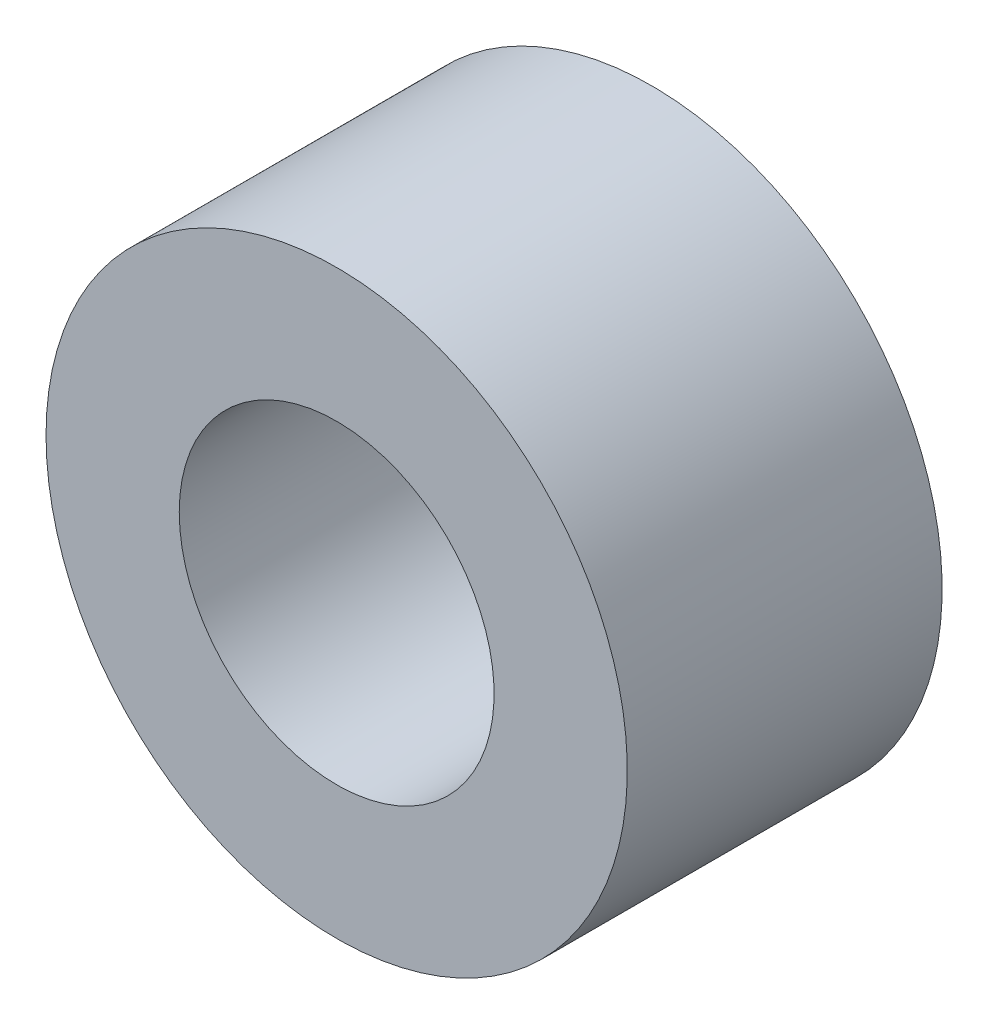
ISO-10303-21;
HEADER;
FILE_DESCRIPTION(('STEP AP214'),'2;1');
FILE_NAME('part.step','',(''),(''),'','','');
FILE_SCHEMA(('AUTOMOTIVE_DESIGN { 1 0 10303 214 1 1 1 1 }'));
ENDSEC;
DATA;
#1=APPLICATION_CONTEXT('core data for automotive mechanical design processes');
#2=APPLICATION_PROTOCOL_DEFINITION('international standard','automotive_design',2000,#1);
#3=PRODUCT_CONTEXT('',#1,'mechanical');
#4=PRODUCT('Part','Part','',(#3));
#5=PRODUCT_RELATED_PRODUCT_CATEGORY('part','',(#4));
#6=PRODUCT_DEFINITION_FORMATION('','',#4);
#7=PRODUCT_DEFINITION_CONTEXT('part definition',#1,'design');
#8=PRODUCT_DEFINITION('design','',#6,#7);
#9=PRODUCT_DEFINITION_SHAPE('','',#8);
#10=(LENGTH_UNIT() NAMED_UNIT(*) SI_UNIT(.MILLI.,.METRE.));
#11=(NAMED_UNIT(*) PLANE_ANGLE_UNIT() SI_UNIT($,.RADIAN.));
#12=(NAMED_UNIT(*) SI_UNIT($,.STERADIAN.) SOLID_ANGLE_UNIT());
#13=UNCERTAINTY_MEASURE_WITH_UNIT(LENGTH_MEASURE(1.E-05),#10,'distance_accuracy_value','');
#14=(GEOMETRIC_REPRESENTATION_CONTEXT(3) GLOBAL_UNCERTAINTY_ASSIGNED_CONTEXT((#13)) GLOBAL_UNIT_ASSIGNED_CONTEXT((#10,
#11,#12)) REPRESENTATION_CONTEXT('',''));
#15=CARTESIAN_POINT('',(0.,0.,0.));
#16=DIRECTION('',(0.,0.,1.));
#17=DIRECTION('',(1.,0.,0.));
#18=AXIS2_PLACEMENT_3D('',#15,#16,#17);
#19=CARTESIAN_POINT('',(0.,0.,6.5));
#20=DIRECTION('',(0.,0.,1.));
#21=DIRECTION('',(1.,0.,0.));
#22=AXIS2_PLACEMENT_3D('',#19,#20,#21);
#23=PLANE('',#22);
#24=CARTESIAN_POINT('',(0.,0.,6.5));
#25=DIRECTION('',(0.,0.,1.));
#26=DIRECTION('',(1.,0.,0.));
#27=AXIS2_PLACEMENT_3D('',#24,#25,#26);
#28=CIRCLE('',#27,6.);
#29=CARTESIAN_POINT('',(-6.,0.,6.5));
#30=VERTEX_POINT('',#29);
#31=EDGE_CURVE('E12',#30,#30,#28,.T.);
#32=ORIENTED_EDGE('',*,*,#31,.T.);
#33=EDGE_LOOP('',(#32));
#34=FACE_BOUND('',#33,.T.);
#35=CARTESIAN_POINT('',(0.,0.,6.5));
#36=DIRECTION('',(0.,0.,1.));
#37=DIRECTION('',(1.,0.,0.));
#38=AXIS2_PLACEMENT_3D('',#35,#36,#37);
#39=CIRCLE('',#38,3.25);
#40=CARTESIAN_POINT('',(-3.25,0.,6.5));
#41=VERTEX_POINT('',#40);
#42=EDGE_CURVE('E53',#41,#41,#39,.T.);
#43=ORIENTED_EDGE('',*,*,#42,.F.);
#44=EDGE_LOOP('',(#43));
#45=FACE_BOUND('',#44,.T.);
#46=ADVANCED_FACE('F42',(#34,#45),#23,.T.);
#47=CARTESIAN_POINT('',(0.,0.,0.));
#48=DIRECTION('',(0.,0.,1.));
#49=DIRECTION('',(1.,0.,0.));
#50=AXIS2_PLACEMENT_3D('',#47,#48,#49);
#51=PLANE('',#50);
#52=CARTESIAN_POINT('',(0.,0.,0.));
#53=DIRECTION('',(0.,0.,1.));
#54=DIRECTION('',(1.,0.,0.));
#55=AXIS2_PLACEMENT_3D('',#52,#53,#54);
#56=CIRCLE('',#55,6.);
#57=CARTESIAN_POINT('',(-6.,0.,0.));
#58=VERTEX_POINT('',#57);
#59=EDGE_CURVE('E46',#58,#58,#56,.T.);
#60=ORIENTED_EDGE('',*,*,#59,.F.);
#61=EDGE_LOOP('',(#60));
#62=FACE_BOUND('',#61,.T.);
#63=CARTESIAN_POINT('',(0.,0.,0.));
#64=DIRECTION('',(0.,0.,1.));
#65=DIRECTION('',(1.,0.,0.));
#66=AXIS2_PLACEMENT_3D('',#63,#64,#65);
#67=CIRCLE('',#66,3.25);
#68=CARTESIAN_POINT('',(-3.25,0.,0.));
#69=VERTEX_POINT('',#68);
#70=EDGE_CURVE('E55',#69,#69,#67,.T.);
#71=ORIENTED_EDGE('',*,*,#70,.T.);
#72=EDGE_LOOP('',(#71));
#73=FACE_BOUND('',#72,.T.);
#74=ADVANCED_FACE('F65',(#62,#73),#51,.F.);
#75=CARTESIAN_POINT('',(0.,0.,6.5));
#76=DIRECTION('',(0.,0.,-1.));
#77=DIRECTION('',(-1.,0.,0.));
#78=AXIS2_PLACEMENT_3D('',#75,#76,#77);
#79=CYLINDRICAL_SURFACE('',#78,6.);
#80=CARTESIAN_POINT('',(-6.,0.,6.5));
#81=CARTESIAN_POINT('',(-6.,0.,6.43229166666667));
#82=CARTESIAN_POINT('',(-6.,0.,6.36458333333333));
#83=CARTESIAN_POINT('',(-6.,0.,6.22916666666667));
#84=CARTESIAN_POINT('',(-6.,0.,6.16145833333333));
#85=CARTESIAN_POINT('',(-6.,0.,6.02604166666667));
#86=CARTESIAN_POINT('',(-6.,0.,5.95833333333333));
#87=CARTESIAN_POINT('',(-6.,0.,5.82291666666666));
#88=CARTESIAN_POINT('',(-6.,0.,5.75520833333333));
#89=CARTESIAN_POINT('',(-6.,0.,5.61979166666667));
#90=CARTESIAN_POINT('',(-6.,0.,5.55208333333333));
#91=CARTESIAN_POINT('',(-6.,0.,5.41666666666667));
#92=CARTESIAN_POINT('',(-6.,0.,5.34895833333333));
#93=CARTESIAN_POINT('',(-6.,0.,5.21354166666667));
#94=CARTESIAN_POINT('',(-6.,0.,5.14583333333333));
#95=CARTESIAN_POINT('',(-6.,0.,5.01041666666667));
#96=CARTESIAN_POINT('',(-6.,0.,4.94270833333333));
#97=CARTESIAN_POINT('',(-6.,0.,4.80729166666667));
#98=CARTESIAN_POINT('',(-6.,0.,4.73958333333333));
#99=CARTESIAN_POINT('',(-6.,0.,4.60416666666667));
#100=CARTESIAN_POINT('',(-6.,0.,4.53645833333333));
#101=CARTESIAN_POINT('',(-6.,0.,4.40104166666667));
#102=CARTESIAN_POINT('',(-6.,0.,4.33333333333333));
#103=CARTESIAN_POINT('',(-6.,0.,4.19791666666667));
#104=CARTESIAN_POINT('',(-6.,0.,4.13020833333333));
#105=CARTESIAN_POINT('',(-6.,0.,3.99479166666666));
#106=CARTESIAN_POINT('',(-6.,0.,3.92708333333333));
#107=CARTESIAN_POINT('',(-6.,0.,3.79166666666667));
#108=CARTESIAN_POINT('',(-6.,0.,3.72395833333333));
#109=CARTESIAN_POINT('',(-6.,0.,3.58854166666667));
#110=CARTESIAN_POINT('',(-6.,0.,3.52083333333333));
#111=CARTESIAN_POINT('',(-6.,0.,3.38541666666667));
#112=CARTESIAN_POINT('',(-6.,0.,3.31770833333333));
#113=CARTESIAN_POINT('',(-6.,0.,3.18229166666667));
#114=CARTESIAN_POINT('',(-6.,0.,3.11458333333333));
#115=CARTESIAN_POINT('',(-6.,0.,2.97916666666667));
#116=CARTESIAN_POINT('',(-6.,0.,2.91145833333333));
#117=CARTESIAN_POINT('',(-6.,0.,2.77604166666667));
#118=CARTESIAN_POINT('',(-6.,0.,2.70833333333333));
#119=CARTESIAN_POINT('',(-6.,0.,2.57291666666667));
#120=CARTESIAN_POINT('',(-6.,0.,2.50520833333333));
#121=CARTESIAN_POINT('',(-6.,0.,2.36979166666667));
#122=CARTESIAN_POINT('',(-6.,0.,2.30208333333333));
#123=CARTESIAN_POINT('',(-6.,0.,2.16666666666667));
#124=CARTESIAN_POINT('',(-6.,0.,2.09895833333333));
#125=CARTESIAN_POINT('',(-6.,0.,1.96354166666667));
#126=CARTESIAN_POINT('',(-6.,0.,1.89583333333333));
#127=CARTESIAN_POINT('',(-6.,0.,1.76041666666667));
#128=CARTESIAN_POINT('',(-6.,0.,1.69270833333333));
#129=CARTESIAN_POINT('',(-6.,0.,1.55729166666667));
#130=CARTESIAN_POINT('',(-6.,0.,1.48958333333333));
#131=CARTESIAN_POINT('',(-6.,0.,1.35416666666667));
#132=CARTESIAN_POINT('',(-6.,0.,1.28645833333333));
#133=CARTESIAN_POINT('',(-6.,0.,1.15104166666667));
#134=CARTESIAN_POINT('',(-6.,0.,1.08333333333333));
#135=CARTESIAN_POINT('',(-6.,0.,0.947916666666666));
#136=CARTESIAN_POINT('',(-6.,0.,0.880208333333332));
#137=CARTESIAN_POINT('',(-6.,0.,0.744791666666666));
#138=CARTESIAN_POINT('',(-6.,0.,0.677083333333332));
#139=CARTESIAN_POINT('',(-6.,0.,0.541666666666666));
#140=CARTESIAN_POINT('',(-6.,0.,0.473958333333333));
#141=CARTESIAN_POINT('',(-6.,0.,0.338541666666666));
#142=CARTESIAN_POINT('',(-6.,0.,0.270833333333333));
#143=CARTESIAN_POINT('',(-6.,0.,0.135416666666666));
#144=CARTESIAN_POINT('',(-6.,0.,0.0677083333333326));
#145=CARTESIAN_POINT('',(-6.,0.,0.));
#146=B_SPLINE_CURVE_WITH_KNOTS('',3,(#80,#81,#82,#83,#84,#85,#86,#87,#88,#89,#90,#91,#92,#93,
#94,#95,#96,#97,#98,#99,#100,#101,#102,#103,#104,#105,#106,#107,#108,#109,#110,#111,#112,#113,
#114,#115,#116,#117,#118,#119,#120,#121,#122,#123,#124,#125,#126,#127,#128,#129,#130,#131,#132,
#133,#134,#135,#136,#137,#138,#139,#140,#141,#142,#143,#144,#145),.UNSPECIFIED.,.F.,.F.,(4,2,2,
2,2,2,2,2,2,2,2,2,2,2,2,2,2,2,2,2,2,2,2,2,2,2,2,2,2,2,2,2,4),(0.,0.203125,0.40625,
0.609375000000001,0.812500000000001,1.015625,1.21875,1.421875,1.625,1.828125,2.03125,2.234375,
2.4375,2.640625,2.84375,3.046875,3.25,3.453125,3.65625,3.859375,4.0625,4.265625,4.46875,
4.671875,4.875,5.078125,5.28125,5.484375,5.6875,5.890625,6.09375,6.296875,6.5),.UNSPECIFIED.);
#147=EDGE_CURVE('BSEAM44',#30,#58,#146,.T.);
#148=ORIENTED_EDGE('',*,*,#31,.F.);
#149=ORIENTED_EDGE('',*,*,#59,.T.);
#150=ORIENTED_EDGE('',*,*,#147,.T.);
#151=ORIENTED_EDGE('',*,*,#147,.F.);
#152=EDGE_LOOP('',(#148,#150,#149,#151));
#153=FACE_BOUND('',#152,.T.);
#154=ADVANCED_FACE('F44',(#153),#79,.T.);
#155=CARTESIAN_POINT('',(0.,0.,6.5));
#156=DIRECTION('',(0.,0.,-1.));
#157=DIRECTION('',(-1.,0.,0.));
#158=AXIS2_PLACEMENT_3D('',#155,#156,#157);
#159=CYLINDRICAL_SURFACE('',#158,3.25);
#160=CARTESIAN_POINT('',(-3.25,0.,6.5));
#161=CARTESIAN_POINT('',(-3.25,0.,6.43229166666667));
#162=CARTESIAN_POINT('',(-3.25,0.,6.36458333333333));
#163=CARTESIAN_POINT('',(-3.25,0.,6.22916666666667));
#164=CARTESIAN_POINT('',(-3.25,0.,6.16145833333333));
#165=CARTESIAN_POINT('',(-3.25,0.,6.02604166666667));
#166=CARTESIAN_POINT('',(-3.25,0.,5.95833333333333));
#167=CARTESIAN_POINT('',(-3.25,0.,5.82291666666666));
#168=CARTESIAN_POINT('',(-3.25,0.,5.75520833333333));
#169=CARTESIAN_POINT('',(-3.25,0.,5.61979166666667));
#170=CARTESIAN_POINT('',(-3.25,0.,5.55208333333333));
#171=CARTESIAN_POINT('',(-3.25,0.,5.41666666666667));
#172=CARTESIAN_POINT('',(-3.25,0.,5.34895833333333));
#173=CARTESIAN_POINT('',(-3.25,0.,5.21354166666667));
#174=CARTESIAN_POINT('',(-3.25,0.,5.14583333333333));
#175=CARTESIAN_POINT('',(-3.25,0.,5.01041666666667));
#176=CARTESIAN_POINT('',(-3.25,0.,4.94270833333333));
#177=CARTESIAN_POINT('',(-3.25,0.,4.80729166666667));
#178=CARTESIAN_POINT('',(-3.25,0.,4.73958333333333));
#179=CARTESIAN_POINT('',(-3.25,0.,4.60416666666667));
#180=CARTESIAN_POINT('',(-3.25,0.,4.53645833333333));
#181=CARTESIAN_POINT('',(-3.25,0.,4.40104166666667));
#182=CARTESIAN_POINT('',(-3.25,0.,4.33333333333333));
#183=CARTESIAN_POINT('',(-3.25,0.,4.19791666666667));
#184=CARTESIAN_POINT('',(-3.25,0.,4.13020833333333));
#185=CARTESIAN_POINT('',(-3.25,0.,3.99479166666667));
#186=CARTESIAN_POINT('',(-3.25,0.,3.92708333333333));
#187=CARTESIAN_POINT('',(-3.25,0.,3.79166666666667));
#188=CARTESIAN_POINT('',(-3.25,0.,3.72395833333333));
#189=CARTESIAN_POINT('',(-3.25,0.,3.58854166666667));
#190=CARTESIAN_POINT('',(-3.25,0.,3.52083333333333));
#191=CARTESIAN_POINT('',(-3.25,0.,3.38541666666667));
#192=CARTESIAN_POINT('',(-3.25,0.,3.31770833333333));
#193=CARTESIAN_POINT('',(-3.25,0.,3.18229166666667));
#194=CARTESIAN_POINT('',(-3.25,0.,3.11458333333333));
#195=CARTESIAN_POINT('',(-3.25,0.,2.97916666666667));
#196=CARTESIAN_POINT('',(-3.25,0.,2.91145833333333));
#197=CARTESIAN_POINT('',(-3.25,0.,2.77604166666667));
#198=CARTESIAN_POINT('',(-3.25,0.,2.70833333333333));
#199=CARTESIAN_POINT('',(-3.25,0.,2.57291666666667));
#200=CARTESIAN_POINT('',(-3.25,0.,2.50520833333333));
#201=CARTESIAN_POINT('',(-3.25,0.,2.36979166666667));
#202=CARTESIAN_POINT('',(-3.25,0.,2.30208333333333));
#203=CARTESIAN_POINT('',(-3.25,0.,2.16666666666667));
#204=CARTESIAN_POINT('',(-3.25,0.,2.09895833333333));
#205=CARTESIAN_POINT('',(-3.25,0.,1.96354166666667));
#206=CARTESIAN_POINT('',(-3.25,0.,1.89583333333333));
#207=CARTESIAN_POINT('',(-3.25,0.,1.76041666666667));
#208=CARTESIAN_POINT('',(-3.25,0.,1.69270833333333));
#209=CARTESIAN_POINT('',(-3.25,0.,1.55729166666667));
#210=CARTESIAN_POINT('',(-3.25,0.,1.48958333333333));
#211=CARTESIAN_POINT('',(-3.25,0.,1.35416666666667));
#212=CARTESIAN_POINT('',(-3.25,0.,1.28645833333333));
#213=CARTESIAN_POINT('',(-3.25,0.,1.15104166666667));
#214=CARTESIAN_POINT('',(-3.25,0.,1.08333333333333));
#215=CARTESIAN_POINT('',(-3.25,0.,0.947916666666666));
#216=CARTESIAN_POINT('',(-3.25,0.,0.880208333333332));
#217=CARTESIAN_POINT('',(-3.25,0.,0.744791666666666));
#218=CARTESIAN_POINT('',(-3.25,0.,0.677083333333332));
#219=CARTESIAN_POINT('',(-3.25,0.,0.541666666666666));
#220=CARTESIAN_POINT('',(-3.25,0.,0.473958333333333));
#221=CARTESIAN_POINT('',(-3.25,0.,0.338541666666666));
#222=CARTESIAN_POINT('',(-3.25,0.,0.270833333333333));
#223=CARTESIAN_POINT('',(-3.25,0.,0.135416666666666));
#224=CARTESIAN_POINT('',(-3.25,0.,0.0677083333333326));
#225=CARTESIAN_POINT('',(-3.25,0.,0.));
#226=B_SPLINE_CURVE_WITH_KNOTS('',3,(#160,#161,#162,#163,#164,#165,#166,#167,#168,#169,#170,
#171,#172,#173,#174,#175,#176,#177,#178,#179,#180,#181,#182,#183,#184,#185,#186,#187,#188,#189,
#190,#191,#192,#193,#194,#195,#196,#197,#198,#199,#200,#201,#202,#203,#204,#205,#206,#207,#208,
#209,#210,#211,#212,#213,#214,#215,#216,#217,#218,#219,#220,#221,#222,#223,#224,#225),
.UNSPECIFIED.,.F.,.F.,(4,2,2,2,2,2,2,2,2,2,2,2,2,2,2,2,2,2,2,2,2,2,2,2,2,2,2,2,2,2,2,2,4),(0.,
0.203124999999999,0.40625,0.609375,0.8125,1.015625,1.21875,1.421875,1.625,1.828125,2.03125,
2.234375,2.4375,2.640625,2.84375,3.046875,3.25,3.453125,3.65625,3.859375,4.0625,4.265625,
4.46875,4.671875,4.875,5.078125,5.28125,5.484375,5.6875,5.890625,6.09375,6.296875,6.5),.UNSPECIFIED.);
#227=EDGE_CURVE('BSEAM61',#41,#69,#226,.T.);
#228=ORIENTED_EDGE('',*,*,#42,.T.);
#229=ORIENTED_EDGE('',*,*,#70,.F.);
#230=ORIENTED_EDGE('',*,*,#227,.T.);
#231=ORIENTED_EDGE('',*,*,#227,.F.);
#232=EDGE_LOOP('',(#228,#230,#229,#231));
#233=FACE_BOUND('',#232,.T.);
#234=ADVANCED_FACE('F61',(#233),#159,.F.);
#235=CLOSED_SHELL('',(#46,#74,#154,#234));
#236=MANIFOLD_SOLID_BREP('B2',#235);
#237=ADVANCED_BREP_SHAPE_REPRESENTATION('',(#18,#236),#14);
#238=SHAPE_DEFINITION_REPRESENTATION(#9,#237);
ENDSEC;
END-ISO-10303-21;
